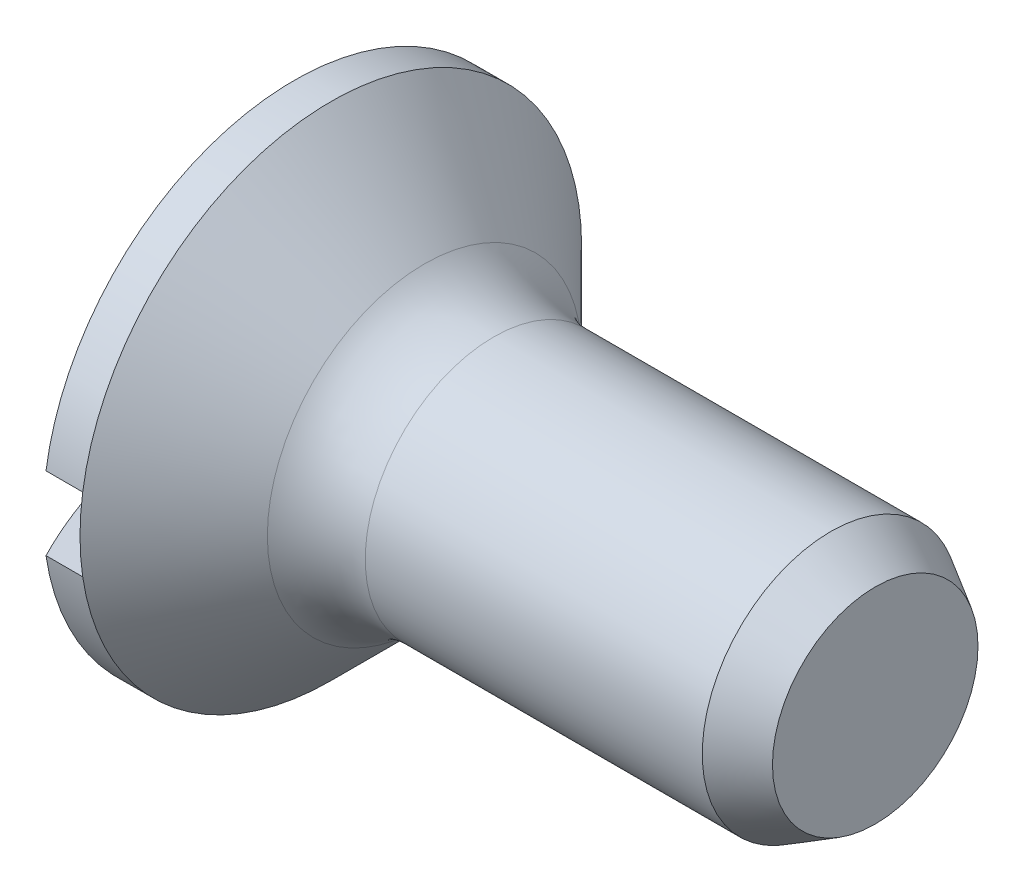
from build123d import *

# Parameters (mm, degrees)
CUT_EXTRUDE1_DEPTH      = 12.129690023
CUT_EXTRUDE1_DEPTH_BACK = 12.129690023
SKETCH2_W               = 1.6
SKETCH2_H               = 1.2
CHAMFER1_SIZE           = 0.42
CHAMFER1_SIZE2          = 0.727461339
FILLET1_R               = 1.6


with BuildPart() as part:
    # Sketch1 → Revolve1 (revolve)
    with BuildSketch(Plane.XY):
        with BuildLine():
            Line((0, 4.1), (0.6, 4.1))
            Line((0.6, 4.1), (2.6, 2.1))
            Line((2.6, 2.1), (9.5, 2.1))
            Line((9.5, 2.1), (9.5, 0))
            Line((9.5, 0), (0, 0))
            Line((0, 0), (-1, 0))
            ThreePointArc((-1, 0), (-0.746388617, 2.110094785), (0, 4.1))
        make_face()
    revolve(axis=Axis((6.620684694, 0, 0), (-1, 0, 0)))

    # Sketch2 → Cut-Extrude1 (cut, two sides: drawn at the far end of the back side and taken through both)
    with BuildSketch(Plane.XY.offset(-CUT_EXTRUDE1_DEPTH_BACK)):
        with Locations((-0.2, 0)):
            Rectangle(SKETCH2_W, SKETCH2_H)
    extrude(amount=CUT_EXTRUDE1_DEPTH + CUT_EXTRUDE1_DEPTH_BACK, mode=Mode.SUBTRACT)

    # Chamfer1
    chamfer1_edges = [part.edges().sort_by_distance(p)[0] for p in [
        (9.5, -2.1, 0),
    ]]
    chamfer1_side = [part.faces().sort_by_distance(p)[0] for p in [
        (9.5, 0, 0),
    ]]
    chamfer(chamfer1_edges, length=CHAMFER1_SIZE, length2=CHAMFER1_SIZE2, reference=chamfer1_side[0])

    # Fillet1
    fillet1_edges = [part.edges().sort_by_distance(p)[0] for p in [
        (2.6, -2.1, 0),
    ]]
    fillet(fillet1_edges, radius=FILLET1_R)


solid = part.part
